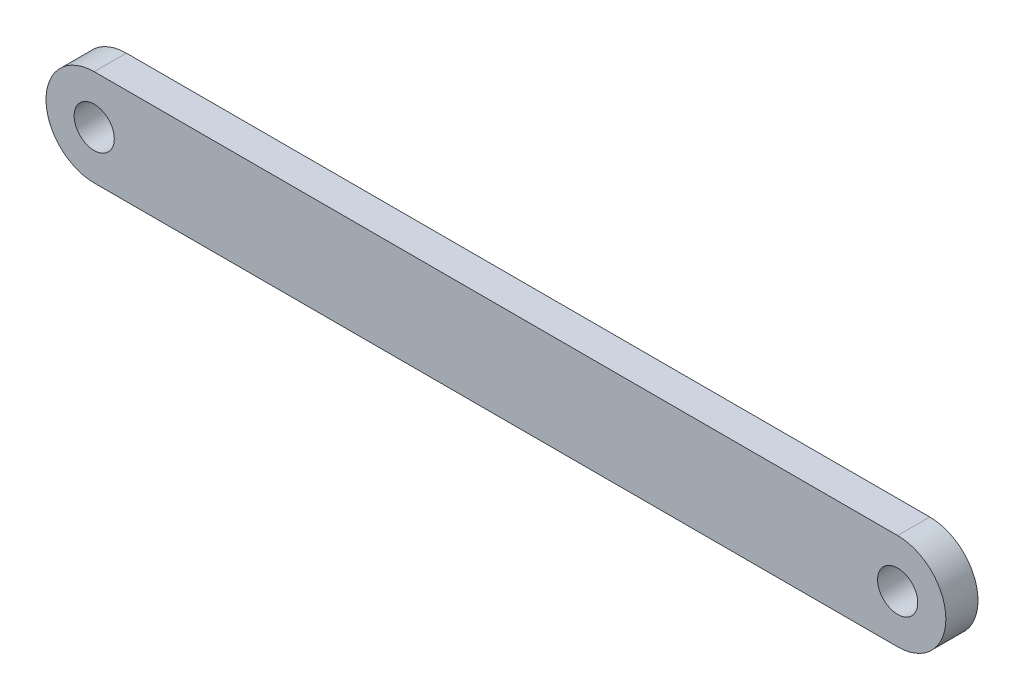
from build123d import *

# Parameters (mm, degrees)
SKETCH_1_R      = 2.5
EXTRUDE_1_DEPTH = 4


with BuildPart() as part:
    # Sketch 1 → Extrude 1 (new body)
    with BuildSketch(Plane.XY):
        with BuildLine():
            Line((-50, 6), (50, 6))
            ThreePointArc((50, 6), (56, 0), (50, -6))
            Line((50, -6), (-50, -6))
            ThreePointArc((-50, -6), (-56, 0), (-50, 6))
        make_face()
        with Locations((-50, 0)):
            Circle(SKETCH_1_R, mode=Mode.SUBTRACT)
        with Locations((50, 0)):
            Circle(SKETCH_1_R, mode=Mode.SUBTRACT)
    extrude(amount=EXTRUDE_1_DEPTH)


solid = part.part
